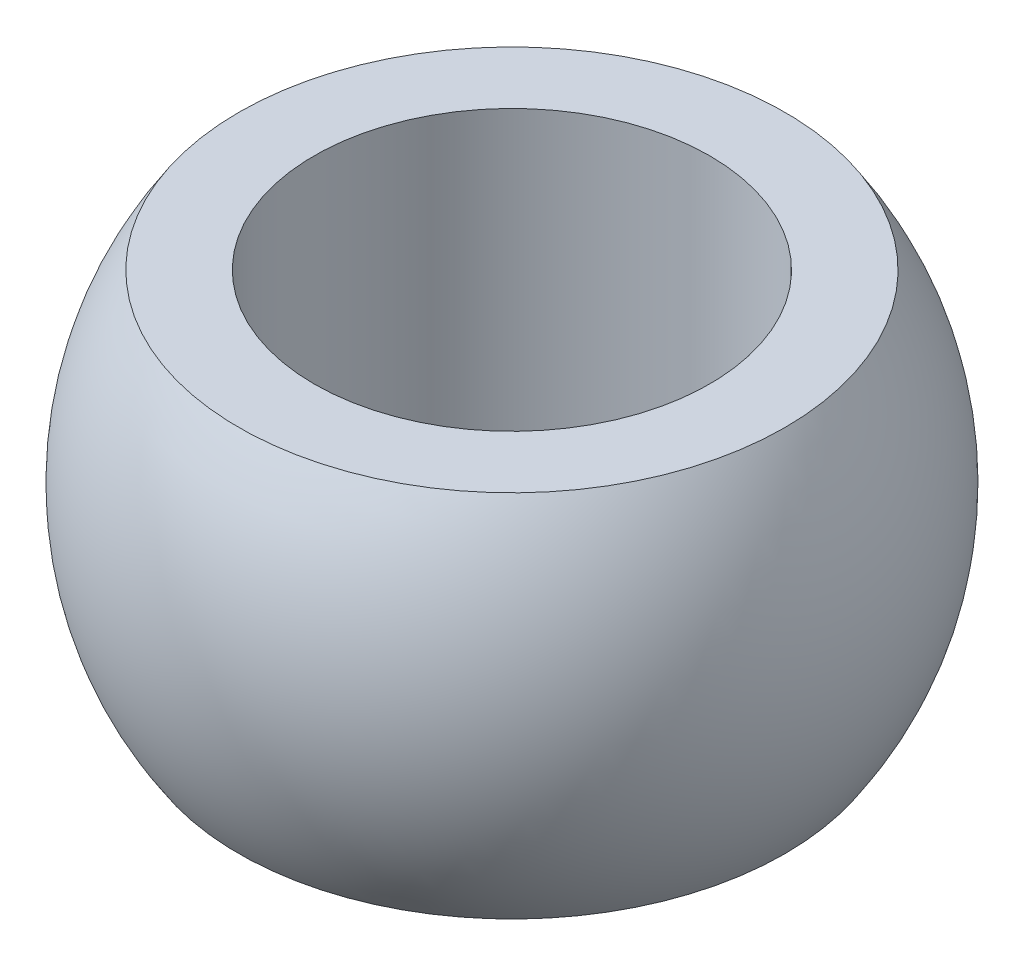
from build123d import *


with BuildPart() as part:
    # Esquisse1 → Base-R_volution (revolve)
    with BuildSketch(Plane.XY):
        with BuildLine():
            Line((10.356157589, 7), (7.5, 7))
            Line((7.5, 7), (7.5, -7))
            Line((7.5, -7), (10.356157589, -7))
            ThreePointArc((10.356157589, -7), (12.5, 0), (10.356157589, 7))
        make_face()
    revolve(axis=Axis((0, 10.38025654, 0), (0, -1, 0)))


solid = part.part
